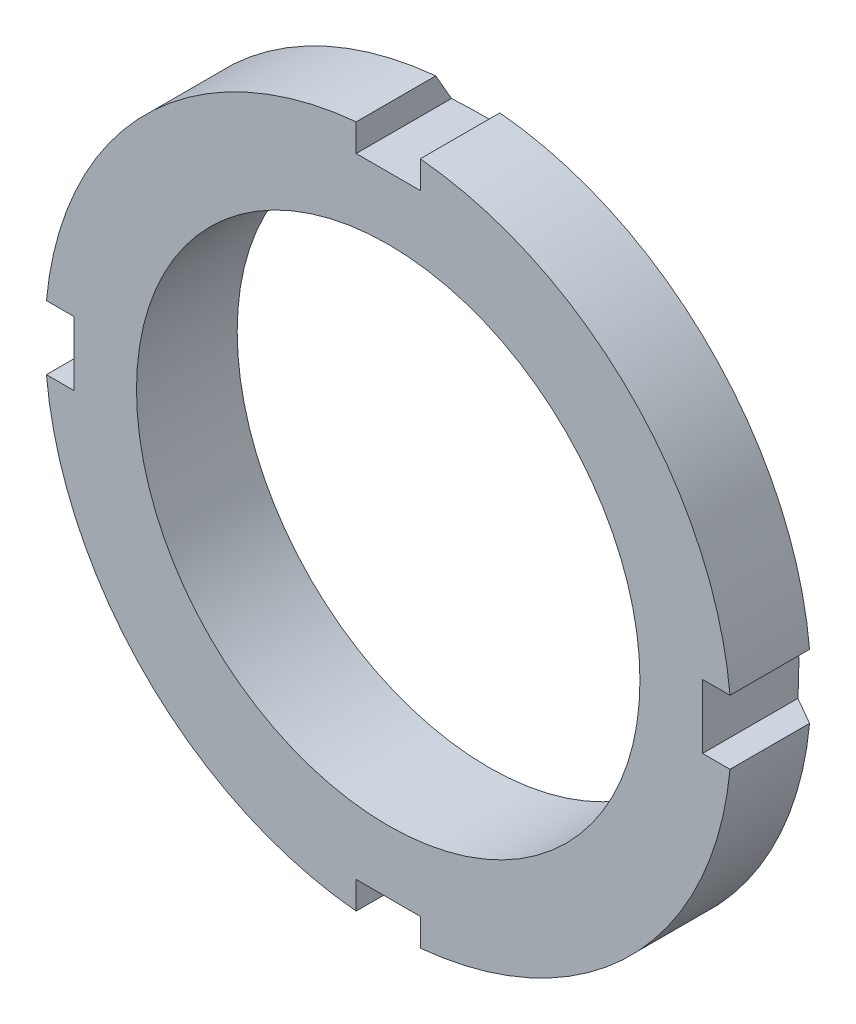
from build123d import *

# Parameters (mm, degrees)
ESQUISSE2_OUTSIDE_W     = 98.326
ESQUISSE2_OUTSIDE_H     = 98.326
ENL_V_MAT_EXTRU_2_DEPTH = 55.161794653


with BuildPart() as part:
    # Esquisse1 → Base-R_volution (revolve)
    with BuildSketch(Plane(origin=(0, 0, 0), x_dir=(0, 0, -1), z_dir=(1, 0, 0)), mode=Mode.PRIVATE) as base_r_volution_sk:
        Polygon((0, 27.5), (0, 33.5), (-2.309401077, 37.5), (-11, 37.5), (-11, 27.5), align=None)
    revolve(base_r_volution_sk.sketch.rotate(Axis((0, 0, 0), (0, 0, 1)), 264.644599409), axis=Axis((0, 0, 0), (0, 0, 1)))

    # Esquisse2 outside → Enl_v. mat.-Extru.2 (cut, through all)
    with BuildSketch(Plane.XY):
        Rectangle(ESQUISSE2_OUTSIDE_W, ESQUISSE2_OUTSIDE_H)
        with BuildLine():
            Line((-3.5, 34.336309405), (3.5, 34.336309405))
            Line((3.5, 34.336309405), (3.5, 37.336309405))
            ThreePointArc((3.5, 37.336309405), (26.516504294, 26.516504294), (37.336309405, 3.5))
            Line((37.336309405, 3.5), (34.336309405, 3.5))
            Line((34.336309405, 3.5), (34.336309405, -3.5))
            Line((34.336309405, -3.5), (37.336309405, -3.5))
            ThreePointArc((37.336309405, -3.5), (26.516504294, -26.516504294), (3.5, -37.336309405))
            Line((3.5, -37.336309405), (3.5, -34.336309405))
            Line((3.5, -34.336309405), (-3.5, -34.336309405))
            Line((-3.5, -34.336309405), (-3.5, -37.336309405))
            ThreePointArc((-3.5, -37.336309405), (-26.516504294, -26.516504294), (-37.336309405, -3.5))
            Line((-37.336309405, -3.5), (-34.336309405, -3.5))
            Line((-34.336309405, -3.5), (-34.336309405, 3.5))
            Line((-34.336309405, 3.5), (-37.336309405, 3.5))
            ThreePointArc((-37.336309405, 3.5), (-26.516504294, 26.516504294), (-3.5, 37.336309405))
            Line((-3.5, 37.336309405), (-3.5, 34.336309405))
        make_face(mode=Mode.SUBTRACT)
    extrude(amount=ENL_V_MAT_EXTRU_2_DEPTH, mode=Mode.SUBTRACT)


solid = part.part
